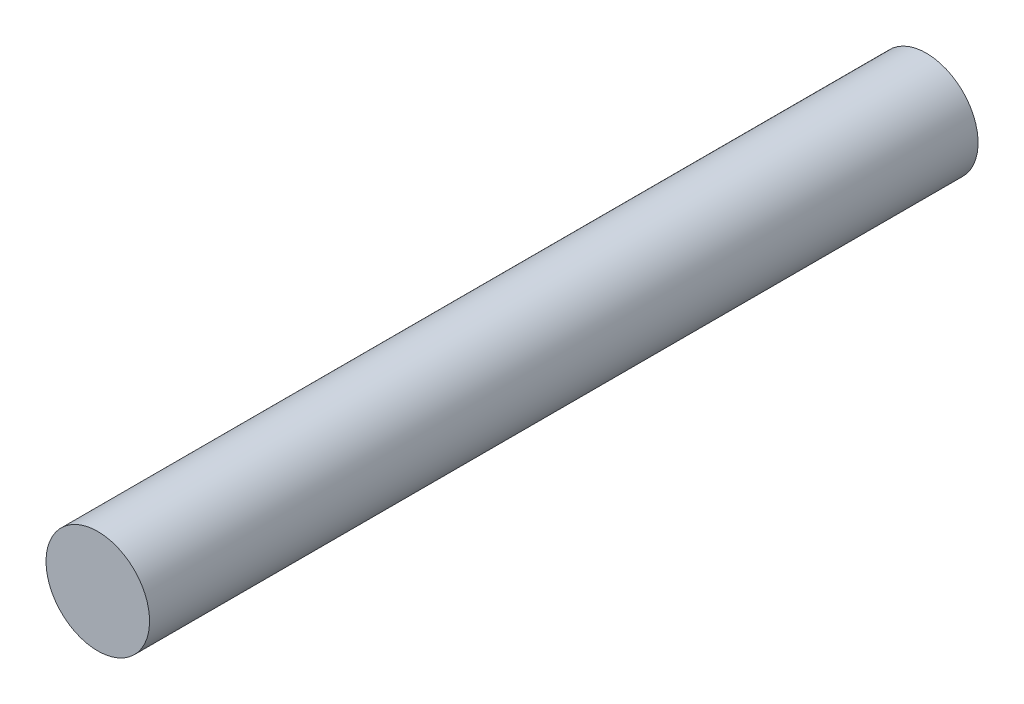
ISO-10303-21;
HEADER;
FILE_DESCRIPTION(('STEP AP214'),'2;1');
FILE_NAME('part.step','',(''),(''),'','','');
FILE_SCHEMA(('AUTOMOTIVE_DESIGN { 1 0 10303 214 1 1 1 1 }'));
ENDSEC;
DATA;
#1=APPLICATION_CONTEXT('core data for automotive mechanical design processes');
#2=APPLICATION_PROTOCOL_DEFINITION('international standard','automotive_design',2000,#1);
#3=PRODUCT_CONTEXT('',#1,'mechanical');
#4=PRODUCT('Part','Part','',(#3));
#5=PRODUCT_RELATED_PRODUCT_CATEGORY('part','',(#4));
#6=PRODUCT_DEFINITION_FORMATION('','',#4);
#7=PRODUCT_DEFINITION_CONTEXT('part definition',#1,'design');
#8=PRODUCT_DEFINITION('design','',#6,#7);
#9=PRODUCT_DEFINITION_SHAPE('','',#8);
#10=(LENGTH_UNIT() NAMED_UNIT(*) SI_UNIT(.MILLI.,.METRE.));
#11=(NAMED_UNIT(*) PLANE_ANGLE_UNIT() SI_UNIT($,.RADIAN.));
#12=(NAMED_UNIT(*) SI_UNIT($,.STERADIAN.) SOLID_ANGLE_UNIT());
#13=UNCERTAINTY_MEASURE_WITH_UNIT(LENGTH_MEASURE(1.E-05),#10,'distance_accuracy_value','');
#14=(GEOMETRIC_REPRESENTATION_CONTEXT(3) GLOBAL_UNCERTAINTY_ASSIGNED_CONTEXT((#13)) GLOBAL_UNIT_ASSIGNED_CONTEXT((#10,
#11,#12)) REPRESENTATION_CONTEXT('',''));
#15=CARTESIAN_POINT('',(0.,0.,0.));
#16=DIRECTION('',(0.,0.,1.));
#17=DIRECTION('',(1.,0.,0.));
#18=AXIS2_PLACEMENT_3D('',#15,#16,#17);
#19=CARTESIAN_POINT('',(0.25,0.,0.));
#20=DIRECTION('',(0.,0.,-1.));
#21=DIRECTION('',(-1.,0.,0.));
#22=AXIS2_PLACEMENT_3D('',#19,#20,#21);
#23=PLANE('',#22);
#24=CARTESIAN_POINT('',(0.,0.,0.));
#25=DIRECTION('',(0.,0.,-1.));
#26=DIRECTION('',(-1.,0.,0.));
#27=AXIS2_PLACEMENT_3D('',#24,#25,#26);
#28=CIRCLE('',#27,0.25);
#29=CARTESIAN_POINT('',(-0.25,0.,0.));
#30=VERTEX_POINT('',#29);
#31=EDGE_CURVE('E18',#30,#30,#28,.F.);
#32=ORIENTED_EDGE('',*,*,#31,.F.);
#33=EDGE_LOOP('',(#32));
#34=FACE_BOUND('',#33,.T.);
#35=ADVANCED_FACE('F15',(#34),#23,.T.);
#36=CARTESIAN_POINT('',(0.25,0.,4.));
#37=DIRECTION('',(0.,0.,-1.));
#38=DIRECTION('',(-1.,0.,0.));
#39=AXIS2_PLACEMENT_3D('',#36,#37,#38);
#40=PLANE('',#39);
#41=CARTESIAN_POINT('',(0.,0.,4.));
#42=DIRECTION('',(0.,0.,-1.));
#43=DIRECTION('',(-1.,0.,0.));
#44=AXIS2_PLACEMENT_3D('',#41,#42,#43);
#45=CIRCLE('',#44,0.25);
#46=CARTESIAN_POINT('',(-0.25,0.,4.));
#47=VERTEX_POINT('',#46);
#48=EDGE_CURVE('E10',#47,#47,#45,.T.);
#49=ORIENTED_EDGE('',*,*,#48,.F.);
#50=EDGE_LOOP('',(#49));
#51=FACE_BOUND('',#50,.T.);
#52=ADVANCED_FACE('F30',(#51),#40,.F.);
#53=CARTESIAN_POINT('',(0.,0.,0.));
#54=DIRECTION('',(0.,0.,-1.));
#55=DIRECTION('',(-1.,0.,0.));
#56=AXIS2_PLACEMENT_3D('',#53,#54,#55);
#57=CYLINDRICAL_SURFACE('',#56,0.25);
#58=ORIENTED_EDGE('',*,*,#31,.T.);
#59=EDGE_LOOP('',(#58));
#60=FACE_BOUND('',#59,.T.);
#61=ORIENTED_EDGE('',*,*,#48,.T.);
#62=EDGE_LOOP('',(#61));
#63=FACE_BOUND('',#62,.T.);
#64=ADVANCED_FACE('F27',(#60,#63),#57,.T.);
#65=CLOSED_SHELL('',(#35,#52,#64));
#66=MANIFOLD_SOLID_BREP('B1',#65);
#67=ADVANCED_BREP_SHAPE_REPRESENTATION('',(#18,#66),#14);
#68=SHAPE_DEFINITION_REPRESENTATION(#9,#67);
ENDSEC;
END-ISO-10303-21;
